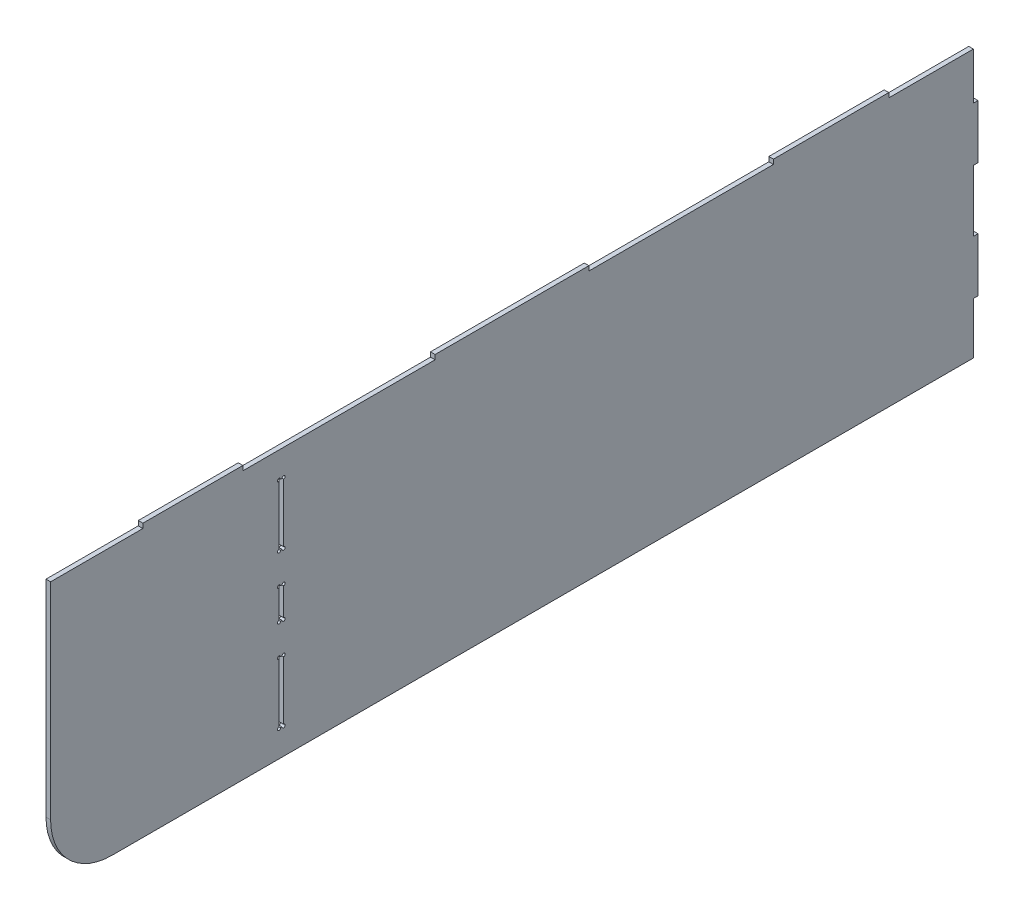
from build123d import *

# Parameters (mm, degrees)
BOSS_EXTRUDE1_DEPTH   = 1200
SKETCH1_W             = 6
SKETCH1_H             = 80
BOSS_EXTRUDE1_2_DEPTH = 1200
SKETCH1_H_2           = 67
BOSS_EXTRUDE1_3_DEPTH = 1200
SKETCH2_W             = 6
SKETCH2_H             = 70
BOSS_EXTRUDE2_DEPTH   = 6
SKETCH3_W             = 6
SKETCH3_H             = 6
CUT_EXTRUDE1_DEPTH    = 1666
SKETCH4_R             = 2
SKETCH4_W             = 6
SKETCH4_H             = 80
CUT_EXTRUDE2_DEPTH    = 151
FILLET1_R             = 80
SKETCH5_W             = 200
SKETCH5_H             = 12
SKETCH5_W_2           = 150
SKETCH5_W_3           = 130
BOSS_EXTRUDE3_DEPTH   = 6
CUT_EXTRUDE3_DEPTH    = 40.5


with BuildPart() as part:
    # Sketch1 → Boss-Extrude1 (new body)
    with BuildSketch(Plane.XY):
        Polygon((-598, 107), (-598, 168), (-598, 174), (-604, 174), (-604, 107), align=None)
    extrude(amount=BOSS_EXTRUDE1_DEPTH)



with BuildPart() as body_2:
    # Sketch1 → Boss-Extrude1 2 (new body)
    with BuildSketch(Plane.XY):
        with Locations((-601, -3)):
            Rectangle(SKETCH1_W, SKETCH1_H)
    extrude(amount=BOSS_EXTRUDE1_2_DEPTH)


with BuildPart() as body_3:
    # Sketch1 → Boss-Extrude1 3 (new body)
    with BuildSketch(Plane.XY):
        with Locations((-601, -146.5)):
            Rectangle(SKETCH1_W, SKETCH1_H_2)
    extrude(amount=BOSS_EXTRUDE1_3_DEPTH)


with BuildPart() as part_1:
    add(part.part)

    add(body_2.part)  # Boss-Extrude2 merges body 2

    add(body_3.part)  # Boss-Extrude2 merges body 3
    # Sketch2 → Boss-Extrude2 (add)
    with BuildSketch(Plane.ZY.offset(604)):
        with Locations((-3, -78)):
            Rectangle(SKETCH2_W, SKETCH2_H)
        with Locations((-3, 72)):
            Rectangle(SKETCH2_W, SKETCH2_H)
        Polygon((1200, 107), (0, 107), (0, 37), (0, -43), (0, -113), (0, -180), (1200, -180), align=None)
    extrude(amount=-BOSS_EXTRUDE2_DEPTH)

    # Sketch3 → Cut-Extrude1 (cut)
    with BuildSketch(Plane.XY.offset(1200)):
        with Locations((-601, 171)):
            Rectangle(SKETCH3_W, SKETCH3_H)
    extrude(amount=-CUT_EXTRUDE1_DEPTH, mode=Mode.SUBTRACT)

    # Sketch4 → Cut-Extrude2 (cut)
    with BuildSketch(Plane.ZY.offset(604)):
        with Locations((897, -66)):
            Circle(SKETCH4_R)
        with Locations((903, -66)):
            Circle(SKETCH4_R)
        with Locations((903, -146)):
            Circle(SKETCH4_R)
        with Locations((897, -146)):
            Circle(SKETCH4_R)
        with BuildLine():
            Line((899, 134), (901, 134))
            ThreePointArc((901, 134), (904.414213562, 135.414213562), (903, 132))
            Line((903, 132), (903, 56))
            ThreePointArc((903, 56), (904.414213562, 52.585786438), (901, 54))
            Line((901, 54), (899, 54))
            ThreePointArc((899, 54), (895.585786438, 52.585786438), (897, 56))
            Line((897, 56), (897, 132))
            ThreePointArc((897, 132), (895.585786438, 135.414213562), (899, 134))
        make_face()
        with Locations((900, -106)):
            Rectangle(SKETCH4_W, SKETCH4_H)
    extrude(amount=-CUT_EXTRUDE2_DEPTH, mode=Mode.SUBTRACT)

    # Fillet1
    fillet1_edges = [part_1.edges().sort_by_distance(p)[0] for p in [
        (-601, -180, 1200),
    ]]
    fillet(fillet1_edges, radius=FILLET1_R)

    # Sketch5 → Boss-Extrude3 (add)
    with BuildSketch(Plane.ZY.offset(604)):
        with Locations((600, 168)):
            Rectangle(SKETCH5_W, SKETCH5_H)
        with Locations((185, 168)):
            Rectangle(SKETCH5_W_2, SKETCH5_H)
        with Locations((1015, 168)):
            Rectangle(SKETCH5_W_3, SKETCH5_H)
    extrude(amount=-BOSS_EXTRUDE3_DEPTH)

    # Sketch6 → Cut-Extrude3 (cut, symmetric)
    with BuildSketch(Plane(origin=(-598, 0, 0), x_dir=(0, 0, -1), z_dir=(1, 0, 0))):
        with BuildLine():
            Line((-901, 14), (-899, 14))
            ThreePointArc((-899, 14), (-895.585786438, 15.414213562), (-897, 12))
            Line((-897, 12), (-897, -24))
            ThreePointArc((-897, -24), (-895.585786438, -27.414213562), (-899, -26))
            Line((-899, -26), (-901, -26))
            ThreePointArc((-901, -26), (-904.414213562, -27.414213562), (-903, -24))
            Line((-903, -24), (-903, 12))
            ThreePointArc((-903, 12), (-904.414213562, 15.414213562), (-901, 14))
        make_face()
    extrude(amount=CUT_EXTRUDE3_DEPTH, both=True, mode=Mode.SUBTRACT)


solid = part_1.part
